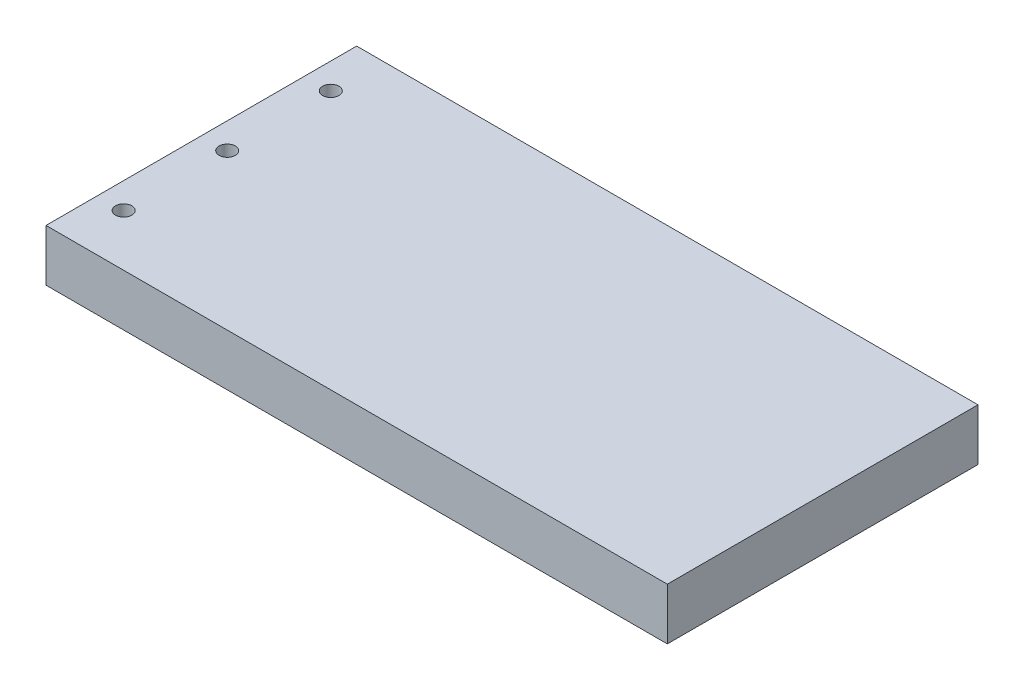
from build123d import *

# Parameters (mm, degrees)
SKETCH1_W           = 152.4
SKETCH1_H           = 76.2
BOSS_EXTRUDE2_DEPTH = 12.7
SKETCH2_R           = 2
CUT_EXTRUDE1_DEPTH  = 92.983481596


with BuildPart() as part:
    # Sketch1 → Boss-Extrude2 (new body)
    with BuildSketch(Plane(origin=(0, 0, 0), x_dir=(1, 0, 0), z_dir=(0, 1, 0))):
        with Locations((3.044501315, -6.844186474)):
            Rectangle(SKETCH1_W, SKETCH1_H)
    extrude(amount=BOSS_EXTRUDE2_DEPTH)

    # Sketch2 → Cut-Extrude1 (cut, through all)
    with BuildSketch(Plane(origin=(0, 12.7, 0), x_dir=(1, 0, 0), z_dir=(0, 1, 0))):
        with Locations(Location((-66.805498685, 18.555813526, 0), (0, 0, 270))):
            Circle(SKETCH2_R)
        with Locations(Location((-66.805498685, -6.844186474, 0), (0, 0, 270))):
            Circle(SKETCH2_R)
        with Locations(Location((-66.805498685, -32.244186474, 0), (0, 0, 270))):
            Circle(SKETCH2_R)
    extrude(amount=-CUT_EXTRUDE1_DEPTH, mode=Mode.SUBTRACT)


solid = part.part
